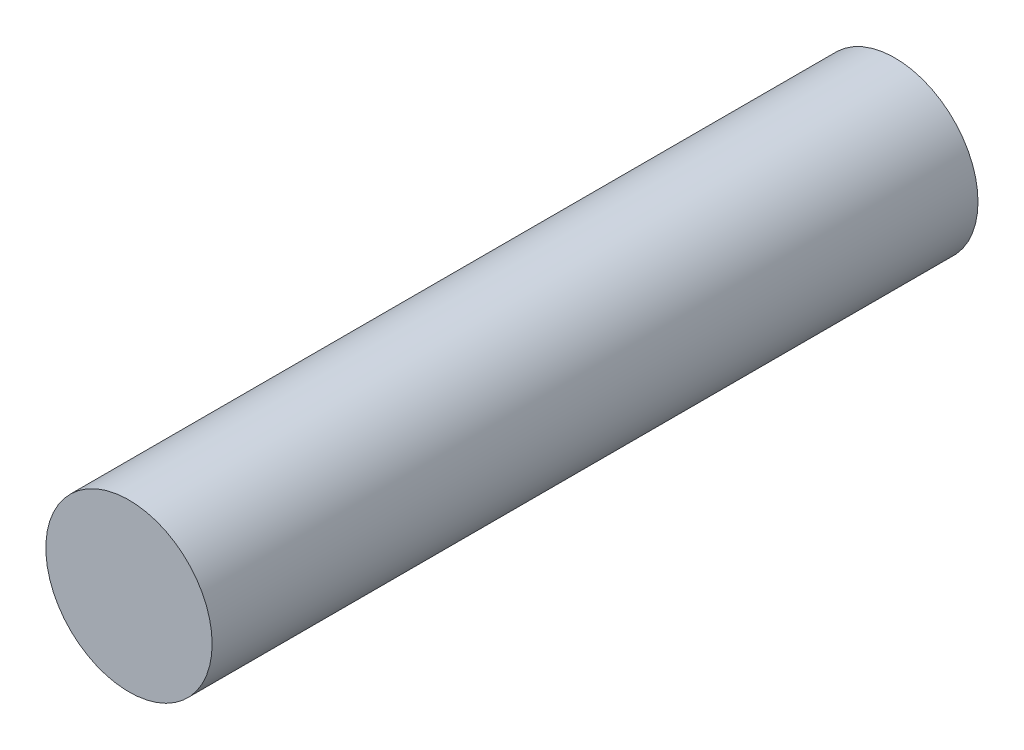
ISO-10303-21;
HEADER;
FILE_DESCRIPTION(('STEP AP214'),'2;1');
FILE_NAME('part.step','',(''),(''),'','','');
FILE_SCHEMA(('AUTOMOTIVE_DESIGN { 1 0 10303 214 1 1 1 1 }'));
ENDSEC;
DATA;
#1=APPLICATION_CONTEXT('core data for automotive mechanical design processes');
#2=APPLICATION_PROTOCOL_DEFINITION('international standard','automotive_design',2000,#1);
#3=PRODUCT_CONTEXT('',#1,'mechanical');
#4=PRODUCT('Part','Part','',(#3));
#5=PRODUCT_RELATED_PRODUCT_CATEGORY('part','',(#4));
#6=PRODUCT_DEFINITION_FORMATION('','',#4);
#7=PRODUCT_DEFINITION_CONTEXT('part definition',#1,'design');
#8=PRODUCT_DEFINITION('design','',#6,#7);
#9=PRODUCT_DEFINITION_SHAPE('','',#8);
#10=(LENGTH_UNIT() NAMED_UNIT(*) SI_UNIT(.MILLI.,.METRE.));
#11=(NAMED_UNIT(*) PLANE_ANGLE_UNIT() SI_UNIT($,.RADIAN.));
#12=(NAMED_UNIT(*) SI_UNIT($,.STERADIAN.) SOLID_ANGLE_UNIT());
#13=UNCERTAINTY_MEASURE_WITH_UNIT(LENGTH_MEASURE(1.E-05),#10,'distance_accuracy_value','');
#14=(GEOMETRIC_REPRESENTATION_CONTEXT(3) GLOBAL_UNCERTAINTY_ASSIGNED_CONTEXT((#13)) GLOBAL_UNIT_ASSIGNED_CONTEXT((#10,
#11,#12)) REPRESENTATION_CONTEXT('',''));
#15=CARTESIAN_POINT('',(0.,0.,0.));
#16=DIRECTION('',(0.,0.,1.));
#17=DIRECTION('',(1.,0.,0.));
#18=AXIS2_PLACEMENT_3D('',#15,#16,#17);
#19=CARTESIAN_POINT('',(0.,0.,175.));
#20=DIRECTION('',(0.,0.,-1.));
#21=DIRECTION('',(-1.,0.,0.));
#22=AXIS2_PLACEMENT_3D('',#19,#20,#21);
#23=CYLINDRICAL_SURFACE('',#22,38.);
#24=CARTESIAN_POINT('',(0.,0.,175.));
#25=DIRECTION('',(0.,0.,1.));
#26=DIRECTION('',(1.,0.,0.));
#27=AXIS2_PLACEMENT_3D('',#24,#25,#26);
#28=CIRCLE('',#27,38.);
#29=CARTESIAN_POINT('',(38.,0.,175.));
#30=VERTEX_POINT('',#29);
#31=EDGE_CURVE('E10',#30,#30,#28,.T.);
#32=ORIENTED_EDGE('',*,*,#31,.F.);
#33=EDGE_LOOP('',(#32));
#34=FACE_BOUND('',#33,.T.);
#35=CARTESIAN_POINT('',(0.,0.,-175.));
#36=DIRECTION('',(0.,0.,1.));
#37=DIRECTION('',(1.,0.,0.));
#38=AXIS2_PLACEMENT_3D('',#35,#36,#37);
#39=CIRCLE('',#38,38.);
#40=CARTESIAN_POINT('',(38.,0.,-175.));
#41=VERTEX_POINT('',#40);
#42=EDGE_CURVE('E34',#41,#41,#39,.T.);
#43=ORIENTED_EDGE('',*,*,#42,.T.);
#44=EDGE_LOOP('',(#43));
#45=FACE_BOUND('',#44,.T.);
#46=ADVANCED_FACE('F31',(#34,#45),#23,.T.);
#47=CARTESIAN_POINT('',(0.,0.,175.));
#48=DIRECTION('',(0.,0.,1.));
#49=DIRECTION('',(1.,0.,0.));
#50=AXIS2_PLACEMENT_3D('',#47,#48,#49);
#51=PLANE('',#50);
#52=ORIENTED_EDGE('',*,*,#31,.T.);
#53=EDGE_LOOP('',(#52));
#54=FACE_BOUND('',#53,.T.);
#55=ADVANCED_FACE('F46',(#54),#51,.T.);
#56=CARTESIAN_POINT('',(0.,0.,-175.));
#57=DIRECTION('',(0.,0.,1.));
#58=DIRECTION('',(1.,0.,0.));
#59=AXIS2_PLACEMENT_3D('',#56,#57,#58);
#60=PLANE('',#59);
#61=ORIENTED_EDGE('',*,*,#42,.F.);
#62=EDGE_LOOP('',(#61));
#63=FACE_BOUND('',#62,.T.);
#64=ADVANCED_FACE('F44',(#63),#60,.F.);
#65=CLOSED_SHELL('',(#46,#55,#64));
#66=MANIFOLD_SOLID_BREP('B2',#65);
#67=ADVANCED_BREP_SHAPE_REPRESENTATION('',(#18,#66),#14);
#68=SHAPE_DEFINITION_REPRESENTATION(#9,#67);
ENDSEC;
END-ISO-10303-21;
